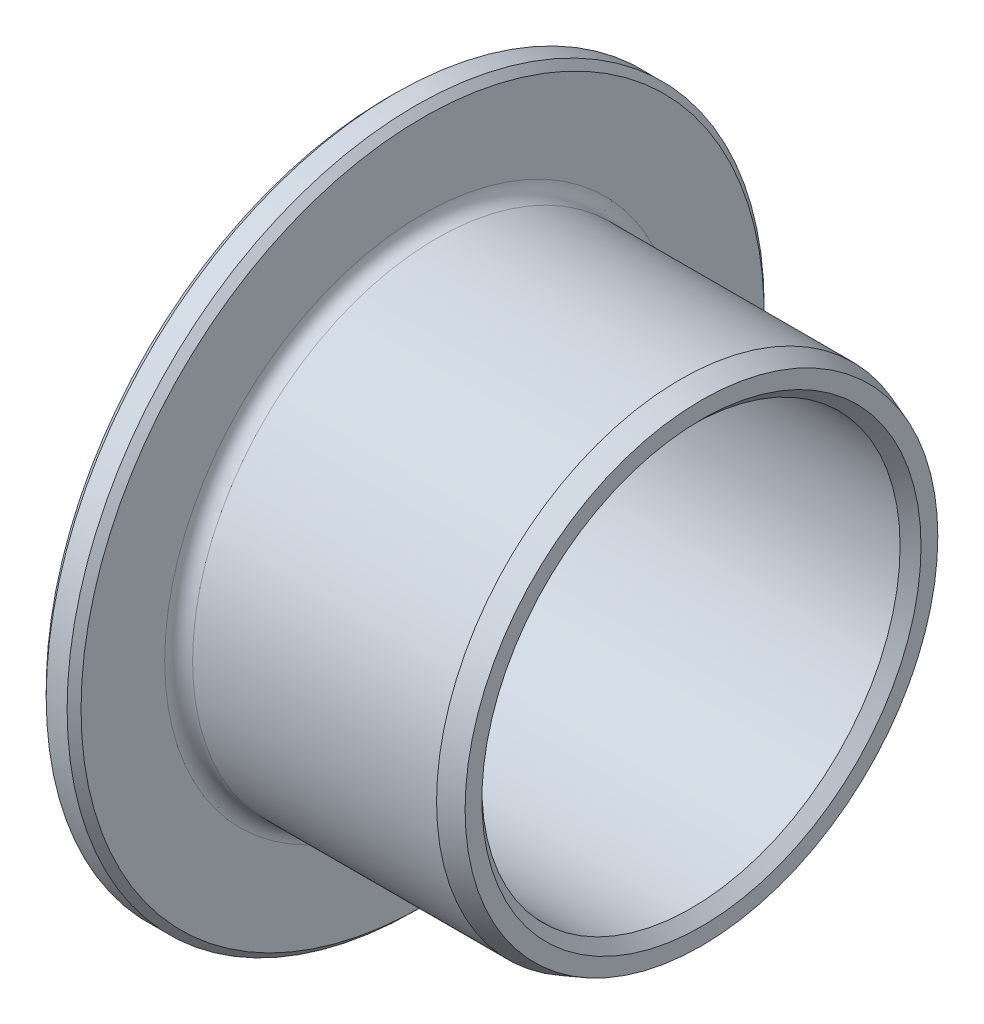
ISO-10303-21;
HEADER;
FILE_DESCRIPTION(('STEP AP214'),'2;1');
FILE_NAME('part.step','',(''),(''),'','','');
FILE_SCHEMA(('AUTOMOTIVE_DESIGN { 1 0 10303 214 1 1 1 1 }'));
ENDSEC;
DATA;
#1=APPLICATION_CONTEXT('core data for automotive mechanical design processes');
#2=APPLICATION_PROTOCOL_DEFINITION('international standard','automotive_design',2000,#1);
#3=PRODUCT_CONTEXT('',#1,'mechanical');
#4=PRODUCT('Part','Part','',(#3));
#5=PRODUCT_RELATED_PRODUCT_CATEGORY('part','',(#4));
#6=PRODUCT_DEFINITION_FORMATION('','',#4);
#7=PRODUCT_DEFINITION_CONTEXT('part definition',#1,'design');
#8=PRODUCT_DEFINITION('design','',#6,#7);
#9=PRODUCT_DEFINITION_SHAPE('','',#8);
#10=(LENGTH_UNIT() NAMED_UNIT(*) SI_UNIT(.MILLI.,.METRE.));
#11=(NAMED_UNIT(*) PLANE_ANGLE_UNIT() SI_UNIT($,.RADIAN.));
#12=(NAMED_UNIT(*) SI_UNIT($,.STERADIAN.) SOLID_ANGLE_UNIT());
#13=UNCERTAINTY_MEASURE_WITH_UNIT(LENGTH_MEASURE(1.E-05),#10,'distance_accuracy_value','');
#14=(GEOMETRIC_REPRESENTATION_CONTEXT(3) GLOBAL_UNCERTAINTY_ASSIGNED_CONTEXT((#13)) GLOBAL_UNIT_ASSIGNED_CONTEXT((#10,
#11,#12)) REPRESENTATION_CONTEXT('',''));
#15=CARTESIAN_POINT('',(0.,0.,0.));
#16=DIRECTION('',(0.,0.,1.));
#17=DIRECTION('',(1.,0.,0.));
#18=AXIS2_PLACEMENT_3D('',#15,#16,#17);
#19=CARTESIAN_POINT('',(0.,10.,0.));
#20=DIRECTION('',(-1.,0.,0.));
#21=DIRECTION('',(0.,0.,1.));
#22=AXIS2_PLACEMENT_3D('',#19,#20,#21);
#23=PLANE('',#22);
#24=CARTESIAN_POINT('',(0.,0.,0.));
#25=DIRECTION('',(-1.,0.,0.));
#26=DIRECTION('',(0.,0.,1.));
#27=AXIS2_PLACEMENT_3D('',#24,#25,#26);
#28=CIRCLE('',#27,7.4);
#29=CARTESIAN_POINT('',(0.,0.,7.4));
#30=VERTEX_POINT('',#29);
#31=EDGE_CURVE('E38',#30,#30,#28,.T.);
#32=ORIENTED_EDGE('',*,*,#31,.T.);
#33=EDGE_LOOP('',(#32));
#34=FACE_BOUND('',#33,.T.);
#35=CARTESIAN_POINT('',(0.,0.,0.));
#36=DIRECTION('',(-1.,0.,0.));
#37=DIRECTION('',(0.,0.,1.));
#38=AXIS2_PLACEMENT_3D('',#35,#36,#37);
#39=CIRCLE('',#38,9.8);
#40=CARTESIAN_POINT('',(0.,0.,9.8));
#41=VERTEX_POINT('',#40);
#42=EDGE_CURVE('E42',#41,#41,#39,.F.);
#43=ORIENTED_EDGE('',*,*,#42,.T.);
#44=EDGE_LOOP('',(#43));
#45=FACE_BOUND('',#44,.T.);
#46=ADVANCED_FACE('F32',(#34,#45),#23,.F.);
#47=CARTESIAN_POINT('',(-5.31268266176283,0.,0.));
#48=DIRECTION('',(-1.,0.,0.));
#49=DIRECTION('',(0.,0.,1.));
#50=AXIS2_PLACEMENT_3D('',#47,#48,#49);
#51=CYLINDRICAL_SURFACE('',#50,7.);
#52=CARTESIAN_POINT('',(0.400000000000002,0.,0.));
#53=DIRECTION('',(-1.,0.,0.));
#54=DIRECTION('',(0.,0.,1.));
#55=AXIS2_PLACEMENT_3D('',#52,#53,#54);
#56=CIRCLE('',#55,7.);
#57=CARTESIAN_POINT('',(0.400000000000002,0.,7.));
#58=VERTEX_POINT('',#57);
#59=EDGE_CURVE('E10',#58,#58,#56,.F.);
#60=ORIENTED_EDGE('',*,*,#59,.T.);
#61=EDGE_LOOP('',(#60));
#62=FACE_BOUND('',#61,.T.);
#63=CARTESIAN_POINT('',(7.4,0.,0.));
#64=DIRECTION('',(-1.,0.,0.));
#65=DIRECTION('',(0.,0.,1.));
#66=AXIS2_PLACEMENT_3D('',#63,#64,#65);
#67=CIRCLE('',#66,7.);
#68=CARTESIAN_POINT('',(7.4,0.,7.));
#69=VERTEX_POINT('',#68);
#70=EDGE_CURVE('E73',#69,#69,#67,.T.);
#71=ORIENTED_EDGE('',*,*,#70,.T.);
#72=EDGE_LOOP('',(#71));
#73=FACE_BOUND('',#72,.T.);
#74=ADVANCED_FACE('F77',(#62,#73),#51,.T.);
#75=CARTESIAN_POINT('',(8.,7.,0.));
#76=DIRECTION('',(-1.,0.,0.));
#77=DIRECTION('',(0.,0.,1.));
#78=AXIS2_PLACEMENT_3D('',#75,#76,#77);
#79=PLANE('',#78);
#80=CARTESIAN_POINT('',(8.,0.,0.));
#81=DIRECTION('',(-1.,0.,0.));
#82=DIRECTION('',(0.,0.,1.));
#83=AXIS2_PLACEMENT_3D('',#80,#81,#82);
#84=CIRCLE('',#83,6.30000000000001);
#85=CARTESIAN_POINT('',(8.,0.,-6.30000000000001));
#86=VERTEX_POINT('',#85);
#87=EDGE_CURVE('E57',#86,#86,#84,.T.);
#88=ORIENTED_EDGE('',*,*,#87,.T.);
#89=EDGE_LOOP('',(#88));
#90=FACE_BOUND('',#89,.T.);
#91=CARTESIAN_POINT('',(8.,0.,0.));
#92=DIRECTION('',(-1.,0.,0.));
#93=DIRECTION('',(0.,0.,1.));
#94=AXIS2_PLACEMENT_3D('',#91,#92,#93);
#95=CIRCLE('',#94,6.78161785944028);
#96=CARTESIAN_POINT('',(8.,0.,6.78161785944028));
#97=VERTEX_POINT('',#96);
#98=EDGE_CURVE('E70',#97,#97,#95,.F.);
#99=ORIENTED_EDGE('',*,*,#98,.T.);
#100=EDGE_LOOP('',(#99));
#101=FACE_BOUND('',#100,.T.);
#102=ADVANCED_FACE('F100',(#90,#101),#79,.F.);
#103=CARTESIAN_POINT('',(-5.31268266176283,0.,0.));
#104=DIRECTION('',(-1.,0.,0.));
#105=DIRECTION('',(0.,0.,1.));
#106=AXIS2_PLACEMENT_3D('',#103,#104,#105);
#107=CYLINDRICAL_SURFACE('',#106,6.);
#108=CARTESIAN_POINT('',(-0.699999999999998,0.,0.));
#109=DIRECTION('',(1.,0.,0.));
#110=DIRECTION('',(0.,0.,-1.));
#111=AXIS2_PLACEMENT_3D('',#108,#109,#110);
#112=CIRCLE('',#111,6.);
#113=CARTESIAN_POINT('',(-0.699999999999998,0.,-6.));
#114=VERTEX_POINT('',#113);
#115=EDGE_CURVE('E63',#114,#114,#112,.F.);
#116=ORIENTED_EDGE('',*,*,#115,.T.);
#117=EDGE_LOOP('',(#116));
#118=FACE_BOUND('',#117,.T.);
#119=CARTESIAN_POINT('',(7.7,0.,0.));
#120=DIRECTION('',(-1.,0.,0.));
#121=DIRECTION('',(0.,0.,1.));
#122=AXIS2_PLACEMENT_3D('',#119,#120,#121);
#123=CIRCLE('',#122,6.);
#124=CARTESIAN_POINT('',(7.7,0.,-6.));
#125=VERTEX_POINT('',#124);
#126=EDGE_CURVE('E67',#125,#125,#123,.F.);
#127=ORIENTED_EDGE('',*,*,#126,.T.);
#128=EDGE_LOOP('',(#127));
#129=FACE_BOUND('',#128,.T.);
#130=ADVANCED_FACE('F131',(#118,#129),#107,.F.);
#131=CARTESIAN_POINT('',(-0.999999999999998,6.,0.));
#132=DIRECTION('',(1.,0.,0.));
#133=DIRECTION('',(0.,0.,-1.));
#134=AXIS2_PLACEMENT_3D('',#131,#132,#133);
#135=PLANE('',#134);
#136=CARTESIAN_POINT('',(-0.999999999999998,0.,0.));
#137=DIRECTION('',(1.,0.,0.));
#138=DIRECTION('',(0.,0.,-1.));
#139=AXIS2_PLACEMENT_3D('',#136,#137,#138);
#140=CIRCLE('',#139,9.8);
#141=CARTESIAN_POINT('',(-0.999999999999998,0.,-9.8));
#142=VERTEX_POINT('',#141);
#143=EDGE_CURVE('E54',#142,#142,#140,.F.);
#144=ORIENTED_EDGE('',*,*,#143,.T.);
#145=EDGE_LOOP('',(#144));
#146=FACE_BOUND('',#145,.T.);
#147=CARTESIAN_POINT('',(-0.999999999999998,0.,0.));
#148=DIRECTION('',(1.,0.,0.));
#149=DIRECTION('',(0.,0.,-1.));
#150=AXIS2_PLACEMENT_3D('',#147,#148,#149);
#151=CIRCLE('',#150,6.3);
#152=CARTESIAN_POINT('',(-0.999999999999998,0.,-6.3));
#153=VERTEX_POINT('',#152);
#154=EDGE_CURVE('E60',#153,#153,#151,.T.);
#155=ORIENTED_EDGE('',*,*,#154,.T.);
#156=EDGE_LOOP('',(#155));
#157=FACE_BOUND('',#156,.T.);
#158=ADVANCED_FACE('F92',(#146,#157),#135,.F.);
#159=CARTESIAN_POINT('',(-5.31268266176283,0.,0.));
#160=DIRECTION('',(-1.,0.,0.));
#161=DIRECTION('',(0.,0.,1.));
#162=AXIS2_PLACEMENT_3D('',#159,#160,#161);
#163=CYLINDRICAL_SURFACE('',#162,10.);
#164=CARTESIAN_POINT('',(-0.8,0.,0.));
#165=DIRECTION('',(1.,0.,0.));
#166=DIRECTION('',(0.,0.,-1.));
#167=AXIS2_PLACEMENT_3D('',#164,#165,#166);
#168=CIRCLE('',#167,10.);
#169=CARTESIAN_POINT('',(-0.8,0.,-10.));
#170=VERTEX_POINT('',#169);
#171=EDGE_CURVE('E46',#170,#170,#168,.T.);
#172=ORIENTED_EDGE('',*,*,#171,.T.);
#173=EDGE_LOOP('',(#172));
#174=FACE_BOUND('',#173,.T.);
#175=CARTESIAN_POINT('',(-0.199999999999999,0.,0.));
#176=DIRECTION('',(-1.,0.,0.));
#177=DIRECTION('',(0.,0.,1.));
#178=AXIS2_PLACEMENT_3D('',#175,#176,#177);
#179=CIRCLE('',#178,10.);
#180=CARTESIAN_POINT('',(-0.199999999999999,0.,10.));
#181=VERTEX_POINT('',#180);
#182=EDGE_CURVE('E51',#181,#181,#179,.T.);
#183=ORIENTED_EDGE('',*,*,#182,.T.);
#184=EDGE_LOOP('',(#183));
#185=FACE_BOUND('',#184,.T.);
#186=ADVANCED_FACE('F82',(#174,#185),#163,.T.);
#187=CARTESIAN_POINT('',(7.4,0.,0.));
#188=DIRECTION('',(-1.,0.,0.));
#189=DIRECTION('',(0.,0.,1.));
#190=AXIS2_PLACEMENT_3D('',#187,#188,#189);
#191=CONICAL_SURFACE('',#190,7.,0.349065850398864);
#192=ORIENTED_EDGE('',*,*,#98,.F.);
#193=EDGE_LOOP('',(#192));
#194=FACE_BOUND('',#193,.T.);
#195=ORIENTED_EDGE('',*,*,#70,.F.);
#196=EDGE_LOOP('',(#195));
#197=FACE_BOUND('',#196,.T.);
#198=ADVANCED_FACE('F79',(#194,#197),#191,.T.);
#199=CARTESIAN_POINT('',(-0.699999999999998,0.,0.));
#200=DIRECTION('',(-1.,0.,0.));
#201=DIRECTION('',(0.,0.,1.));
#202=AXIS2_PLACEMENT_3D('',#199,#200,#201);
#203=CONICAL_SURFACE('',#202,6.,0.785398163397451);
#204=ORIENTED_EDGE('',*,*,#154,.F.);
#205=EDGE_LOOP('',(#204));
#206=FACE_BOUND('',#205,.T.);
#207=ORIENTED_EDGE('',*,*,#115,.F.);
#208=EDGE_LOOP('',(#207));
#209=FACE_BOUND('',#208,.T.);
#210=ADVANCED_FACE('F81',(#206,#209),#203,.F.);
#211=CARTESIAN_POINT('',(8.,0.,0.));
#212=DIRECTION('',(1.,0.,0.));
#213=DIRECTION('',(0.,0.,-1.));
#214=AXIS2_PLACEMENT_3D('',#211,#212,#213);
#215=CONICAL_SURFACE('',#214,6.30000000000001,0.785398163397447);
#216=CARTESIAN_POINT('',(7.7,0.,-6.));
#217=CARTESIAN_POINT('',(7.703125,0.,-6.003125));
#218=CARTESIAN_POINT('',(7.70625,0.,-6.00625));
#219=CARTESIAN_POINT('',(7.7125,0.,-6.0125));
#220=CARTESIAN_POINT('',(7.715625,0.,-6.015625));
#221=CARTESIAN_POINT('',(7.721875,0.,-6.021875));
#222=CARTESIAN_POINT('',(7.725,0.,-6.025));
#223=CARTESIAN_POINT('',(7.73125,0.,-6.03125));
#224=CARTESIAN_POINT('',(7.734375,0.,-6.034375));
#225=CARTESIAN_POINT('',(7.740625,0.,-6.040625));
#226=CARTESIAN_POINT('',(7.74375,0.,-6.04375));
#227=CARTESIAN_POINT('',(7.75,0.,-6.05));
#228=CARTESIAN_POINT('',(7.753125,0.,-6.053125));
#229=CARTESIAN_POINT('',(7.759375,0.,-6.059375));
#230=CARTESIAN_POINT('',(7.7625,0.,-6.0625));
#231=CARTESIAN_POINT('',(7.76875,0.,-6.06875));
#232=CARTESIAN_POINT('',(7.771875,0.,-6.071875));
#233=CARTESIAN_POINT('',(7.778125,0.,-6.078125));
#234=CARTESIAN_POINT('',(7.78125,0.,-6.08125));
#235=CARTESIAN_POINT('',(7.7875,0.,-6.0875));
#236=CARTESIAN_POINT('',(7.790625,0.,-6.090625));
#237=CARTESIAN_POINT('',(7.796875,0.,-6.096875));
#238=CARTESIAN_POINT('',(7.8,0.,-6.1));
#239=CARTESIAN_POINT('',(7.80625,0.,-6.10625));
#240=CARTESIAN_POINT('',(7.809375,0.,-6.109375));
#241=CARTESIAN_POINT('',(7.815625,0.,-6.115625));
#242=CARTESIAN_POINT('',(7.81875,0.,-6.11875));
#243=CARTESIAN_POINT('',(7.825,0.,-6.125));
#244=CARTESIAN_POINT('',(7.828125,0.,-6.128125));
#245=CARTESIAN_POINT('',(7.834375,0.,-6.134375));
#246=CARTESIAN_POINT('',(7.8375,0.,-6.1375));
#247=CARTESIAN_POINT('',(7.84375,0.,-6.14375));
#248=CARTESIAN_POINT('',(7.846875,0.,-6.146875));
#249=CARTESIAN_POINT('',(7.853125,0.,-6.153125));
#250=CARTESIAN_POINT('',(7.85625,0.,-6.15625));
#251=CARTESIAN_POINT('',(7.8625,0.,-6.1625));
#252=CARTESIAN_POINT('',(7.865625,0.,-6.165625));
#253=CARTESIAN_POINT('',(7.871875,0.,-6.171875));
#254=CARTESIAN_POINT('',(7.875,0.,-6.175));
#255=CARTESIAN_POINT('',(7.88125,0.,-6.18125));
#256=CARTESIAN_POINT('',(7.884375,0.,-6.184375));
#257=CARTESIAN_POINT('',(7.890625,0.,-6.190625));
#258=CARTESIAN_POINT('',(7.89375,0.,-6.19375));
#259=CARTESIAN_POINT('',(7.9,0.,-6.2));
#260=CARTESIAN_POINT('',(7.903125,0.,-6.203125));
#261=CARTESIAN_POINT('',(7.909375,0.,-6.209375));
#262=CARTESIAN_POINT('',(7.9125,0.,-6.2125));
#263=CARTESIAN_POINT('',(7.91875,0.,-6.21875000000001));
#264=CARTESIAN_POINT('',(7.921875,0.,-6.22187500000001));
#265=CARTESIAN_POINT('',(7.928125,0.,-6.228125));
#266=CARTESIAN_POINT('',(7.93125,0.,-6.23125));
#267=CARTESIAN_POINT('',(7.9375,0.,-6.23750000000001));
#268=CARTESIAN_POINT('',(7.940625,0.,-6.24062500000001));
#269=CARTESIAN_POINT('',(7.946875,0.,-6.24687500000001));
#270=CARTESIAN_POINT('',(7.95,0.,-6.25000000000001));
#271=CARTESIAN_POINT('',(7.95625,0.,-6.25625));
#272=CARTESIAN_POINT('',(7.959375,0.,-6.25937500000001));
#273=CARTESIAN_POINT('',(7.965625,0.,-6.26562500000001));
#274=CARTESIAN_POINT('',(7.96875,0.,-6.26875000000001));
#275=CARTESIAN_POINT('',(7.975,0.,-6.27500000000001));
#276=CARTESIAN_POINT('',(7.978125,0.,-6.27812500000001));
#277=CARTESIAN_POINT('',(7.984375,0.,-6.28437500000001));
#278=CARTESIAN_POINT('',(7.98750000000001,0.,-6.28750000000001));
#279=CARTESIAN_POINT('',(7.99375,0.,-6.29375000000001));
#280=CARTESIAN_POINT('',(7.996875,0.,-6.29687500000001));
#281=CARTESIAN_POINT('',(8.,0.,-6.30000000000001));
#282=B_SPLINE_CURVE_WITH_KNOTS('',3,(#216,#217,#218,#219,#220,#221,#222,#223,#224,#225,#226,
#227,#228,#229,#230,#231,#232,#233,#234,#235,#236,#237,#238,#239,#240,#241,#242,#243,#244,#245,
#246,#247,#248,#249,#250,#251,#252,#253,#254,#255,#256,#257,#258,#259,#260,#261,#262,#263,#264,
#265,#266,#267,#268,#269,#270,#271,#272,#273,#274,#275,#276,#277,#278,#279,#280,#281),
.UNSPECIFIED.,.F.,.F.,(4,2,2,2,2,2,2,2,2,2,2,2,2,2,2,2,2,2,2,2,2,2,2,2,2,2,2,2,2,2,2,2,4),(0.,
0.0132582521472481,0.0265165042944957,0.0397747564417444,0.053033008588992,0.0662912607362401,
0.0795495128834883,0.0928077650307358,0.106066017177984,0.119324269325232,0.13258252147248,
0.145840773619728,0.159099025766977,0.172357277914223,0.185615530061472,0.19887378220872,
0.212132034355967,0.225390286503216,0.238648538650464,0.251906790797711,0.26516504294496,
0.278423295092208,0.291681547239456,0.304939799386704,0.318198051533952,0.3314563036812,
0.344714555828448,0.357972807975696,0.371231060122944,0.384489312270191,0.39774756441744,
0.411005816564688,0.424264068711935),.UNSPECIFIED.);
#283=EDGE_CURVE('BSEAM89',#125,#86,#282,.T.);
#284=ORIENTED_EDGE('',*,*,#126,.F.);
#285=ORIENTED_EDGE('',*,*,#87,.F.);
#286=ORIENTED_EDGE('',*,*,#283,.T.);
#287=ORIENTED_EDGE('',*,*,#283,.F.);
#288=EDGE_LOOP('',(#284,#286,#285,#287));
#289=FACE_BOUND('',#288,.T.);
#290=ADVANCED_FACE('F89',(#289),#215,.F.);
#291=CARTESIAN_POINT('',(-0.999999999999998,0.,0.));
#292=DIRECTION('',(1.,0.,0.));
#293=DIRECTION('',(0.,0.,-1.));
#294=AXIS2_PLACEMENT_3D('',#291,#292,#293);
#295=CONICAL_SURFACE('',#294,9.8,0.78539816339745);
#296=ORIENTED_EDGE('',*,*,#171,.F.);
#297=EDGE_LOOP('',(#296));
#298=FACE_BOUND('',#297,.T.);
#299=ORIENTED_EDGE('',*,*,#143,.F.);
#300=EDGE_LOOP('',(#299));
#301=FACE_BOUND('',#300,.T.);
#302=ADVANCED_FACE('F108',(#298,#301),#295,.T.);
#303=CARTESIAN_POINT('',(-0.199999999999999,0.,0.));
#304=DIRECTION('',(-1.,0.,0.));
#305=DIRECTION('',(0.,0.,1.));
#306=AXIS2_PLACEMENT_3D('',#303,#304,#305);
#307=CONICAL_SURFACE('',#306,10.,0.785398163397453);
#308=ORIENTED_EDGE('',*,*,#42,.F.);
#309=EDGE_LOOP('',(#308));
#310=FACE_BOUND('',#309,.T.);
#311=ORIENTED_EDGE('',*,*,#182,.F.);
#312=EDGE_LOOP('',(#311));
#313=FACE_BOUND('',#312,.T.);
#314=ADVANCED_FACE('F104',(#310,#313),#307,.T.);
#315=CARTESIAN_POINT('',(0.400000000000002,0.,0.));
#316=DIRECTION('',(-1.,0.,0.));
#317=DIRECTION('',(0.,0.,1.));
#318=AXIS2_PLACEMENT_3D('',#315,#316,#317);
#319=TOROIDAL_SURFACE('',#318,7.4,0.4);
#320=ORIENTED_EDGE('',*,*,#59,.F.);
#321=EDGE_LOOP('',(#320));
#322=FACE_BOUND('',#321,.T.);
#323=ORIENTED_EDGE('',*,*,#31,.F.);
#324=EDGE_LOOP('',(#323));
#325=FACE_BOUND('',#324,.T.);
#326=ADVANCED_FACE('F107',(#322,#325),#319,.F.);
#327=CLOSED_SHELL('',(#46,#74,#102,#130,#158,#186,#198,#210,#290,#302,#314,#326));
#328=MANIFOLD_SOLID_BREP('B2',#327);
#329=ADVANCED_BREP_SHAPE_REPRESENTATION('',(#18,#328),#14);
#330=SHAPE_DEFINITION_REPRESENTATION(#9,#329);
ENDSEC;
END-ISO-10303-21;
